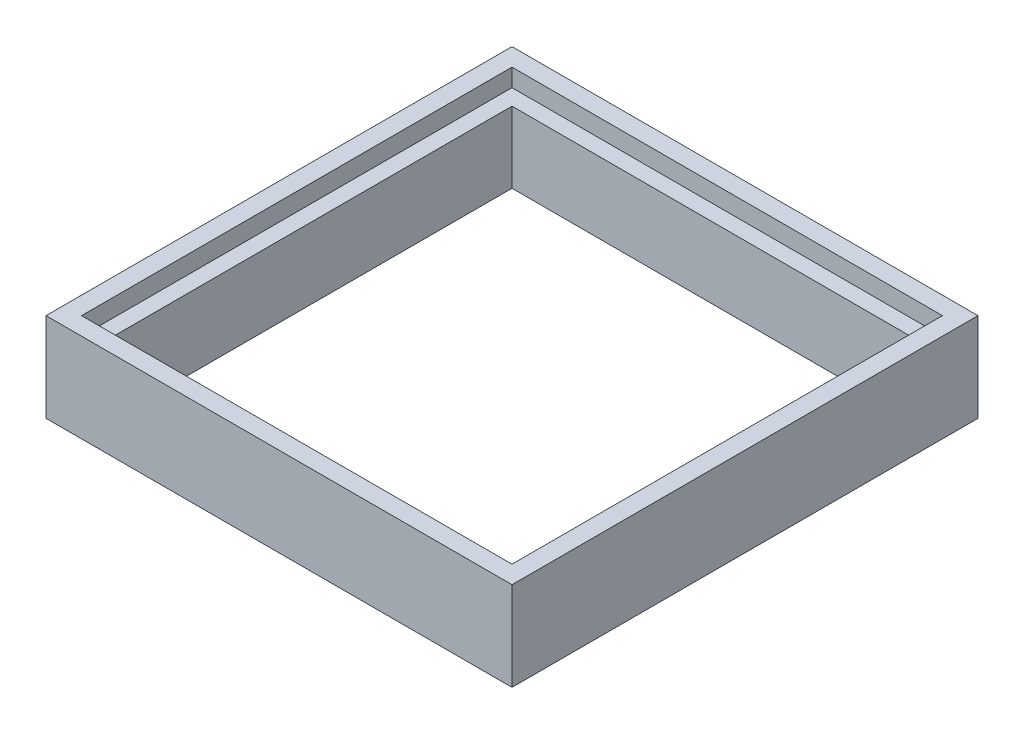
from build123d import *

# Parameters (mm, degrees)
SKETCH2_W           = 32.75
SKETCH2_H           = 32.75
SKETCH2_W_2         = 28
SKETCH2_H_2         = 28
BOSS_EXTRUDE1_DEPTH = 6.25
SKETCH3_W           = 30.25
SKETCH3_H           = 30.25
CUT_EXTRUDE1_DEPTH  = 1.25


with BuildPart() as part:
    # Sketch2 → Boss-Extrude1 (new body)
    with BuildSketch(Plane(origin=(0, 0, 0), x_dir=(1, 0, 0), z_dir=(0, 1, 0))):
        Rectangle(SKETCH2_W, SKETCH2_H)
        Rectangle(SKETCH2_W_2, SKETCH2_H_2, mode=Mode.SUBTRACT)
    extrude(amount=BOSS_EXTRUDE1_DEPTH)

    # Sketch3 → Cut-Extrude1 (cut)
    with BuildSketch(Plane(origin=(0, 6.25, 0), x_dir=(1, 0, 0), z_dir=(0, 1, 0))):
        Rectangle(SKETCH3_W, SKETCH3_H)
    extrude(amount=-CUT_EXTRUDE1_DEPTH, mode=Mode.SUBTRACT)


solid = part.part
